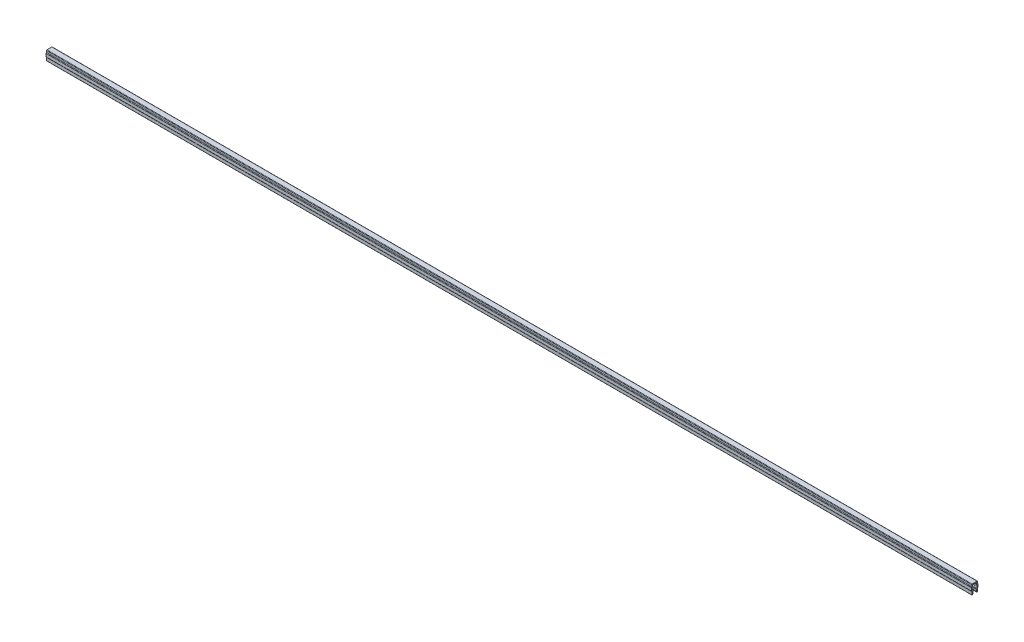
from build123d import *

# Parameters (mm, degrees)
EXTRUDE_1_DEPTH = 1000


with BuildPart() as part:
    # Sketch 1 → Extrude 1 (new body)
    with BuildSketch(Plane(origin=(0, 0, 0), x_dir=(0, 0, -1), z_dir=(1, 0, 0))):
        with BuildLine():
            Line((-2.016424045, -9.483364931), (-2.516424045, -10.349390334))
            Line((-2.516424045, -10.349390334), (-2.716424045, -10.349390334))
            ThreePointArc((-2.716424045, -10.349390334), (-2.92855608, -10.261522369), (-3.016424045, -10.049390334))
            Line((-3.016424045, -10.049390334), (-3.016424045, -7.035869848))
            ThreePointArc((-3.016424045, -7.035869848), (-3.110206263, -6.685869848), (-3.366424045, -6.429652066))
            ThreePointArc((-3.366424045, -6.429652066), (-3.549436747, -6.246639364), (-3.616424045, -5.996639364))
            Line((-3.616424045, -5.996639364), (-3.616424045, -3.074085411))
            ThreePointArc((-3.616424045, -3.074085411), (-3.565782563, -2.854820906), (-3.424116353, -2.67997192))
            ThreePointArc((-3.424116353, -2.67997192), (-3.197450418, -2.400213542), (-3.116424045, -2.049390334))
            Line((-3.116424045, -2.049390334), (-3.116424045, -0.5))
            ThreePointArc((-3.116424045, -0.5), (-2.969977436, -0.146446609), (-2.616424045, 0))
            Line((-2.616424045, 0), (2.616424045, 0))
            ThreePointArc((2.616424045, 0), (2.969977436, -0.146446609), (3.116424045, -0.5))
            Line((3.116424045, -0.5), (3.116424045, -2.208060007))
            ThreePointArc((3.116424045, -2.208060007), (3.183411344, -2.458060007), (3.366424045, -2.641072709))
            ThreePointArc((3.366424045, -2.641072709), (3.549436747, -2.824085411), (3.616424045, -3.074085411))
            Line((3.616424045, -3.074085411), (3.616424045, -5.996639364))
            ThreePointArc((3.616424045, -5.996639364), (3.549436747, -6.246639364), (3.366424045, -6.429652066))
            ThreePointArc((3.366424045, -6.429652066), (3.110206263, -6.685869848), (3.016424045, -7.035869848))
            Line((3.016424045, -7.035869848), (3.016424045, -10.049390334))
            ThreePointArc((3.016424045, -10.049390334), (2.92855608, -10.261522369), (2.716424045, -10.349390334))
            Line((2.716424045, -10.349390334), (2.516424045, -10.349390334))
            Line((2.516424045, -10.349390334), (2.016424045, -9.483364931))
            Line((2.016424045, -9.483364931), (2.016424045, -7.415484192))
            ThreePointArc((2.016424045, -7.415484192), (1.969577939, -7.204175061), (1.83781785, -7.03246197))
            Line((1.83781785, -7.03246197), (0.896638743, -6.242718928))
            ThreePointArc((0.896638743, -6.242718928), (0.837257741, -6.021106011), (1.025196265, -5.88951004))
            Line((1.025196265, -5.88951004), (1.816424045, -5.88951004))
            ThreePointArc((1.816424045, -5.88951004), (2.38210947, -5.655195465), (2.616424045, -5.08951004))
            Line((2.616424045, -5.08951004), (2.616424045, -3.639601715))
            ThreePointArc((2.616424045, -3.639601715), (2.549436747, -3.389601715), (2.366424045, -3.206589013))
            ThreePointArc((2.366424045, -3.206589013), (2.183411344, -3.023576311), (2.116424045, -2.773576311))
            Line((2.116424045, -2.773576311), (2.116424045, -1.5))
            ThreePointArc((2.116424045, -1.5), (1.969977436, -1.146446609), (1.616424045, -1))
            Line((1.616424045, -1), (-1.616424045, -1))
            ThreePointArc((-1.616424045, -1), (-1.969977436, -1.146446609), (-2.116424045, -1.5))
            Line((-2.116424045, -1.5), (-2.116424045, -2.773576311))
            ThreePointArc((-2.116424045, -2.773576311), (-2.183411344, -3.023576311), (-2.366424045, -3.206589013))
            ThreePointArc((-2.366424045, -3.206589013), (-2.549436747, -3.389601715), (-2.616424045, -3.639601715))
            Line((-2.616424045, -3.639601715), (-2.616424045, -5.08951004))
            ThreePointArc((-2.616424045, -5.08951004), (-2.38210947, -5.655195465), (-1.816424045, -5.88951004))
            Line((-1.816424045, -5.88951004), (-1.025196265, -5.88951004))
            ThreePointArc((-1.025196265, -5.88951004), (-0.837257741, -6.021106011), (-0.896638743, -6.242718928))
            Line((-0.896638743, -6.242718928), (-1.83781785, -7.03246197))
            ThreePointArc((-1.83781785, -7.03246197), (-1.969577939, -7.204175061), (-2.016424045, -7.415484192))
            Line((-2.016424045, -7.415484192), (-2.016424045, -9.483364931))
        make_face()
    extrude(amount=EXTRUDE_1_DEPTH)


solid = part.part
